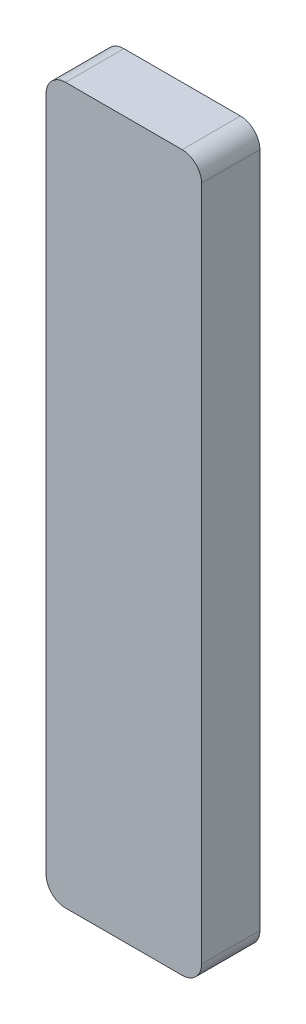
from build123d import *

# Parameters (mm, degrees)
BOSS_EXTRUDE1_DEPTH = 3


with BuildPart() as part:
    # Sketch1 → Boss-Extrude1 (new body)
    with BuildSketch(Plane.XY):
        with BuildLine():
            Line((3, 18.4), (-3, 18.4))
            ThreePointArc((-3, 18.4), (-3.707106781, 18.107106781), (-4, 17.4))
            Line((-4, 17.4), (-4, -17.4))
            ThreePointArc((-4, -17.4), (-3.707106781, -18.107106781), (-3, -18.4))
            Line((-3, -18.4), (3, -18.4))
            ThreePointArc((3, -18.4), (3.707106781, -18.107106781), (4, -17.4))
            Line((4, -17.4), (4, 17.4))
            ThreePointArc((4, 17.4), (3.707106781, 18.107106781), (3, 18.4))
        make_face()
    extrude(amount=BOSS_EXTRUDE1_DEPTH)


solid = part.part
